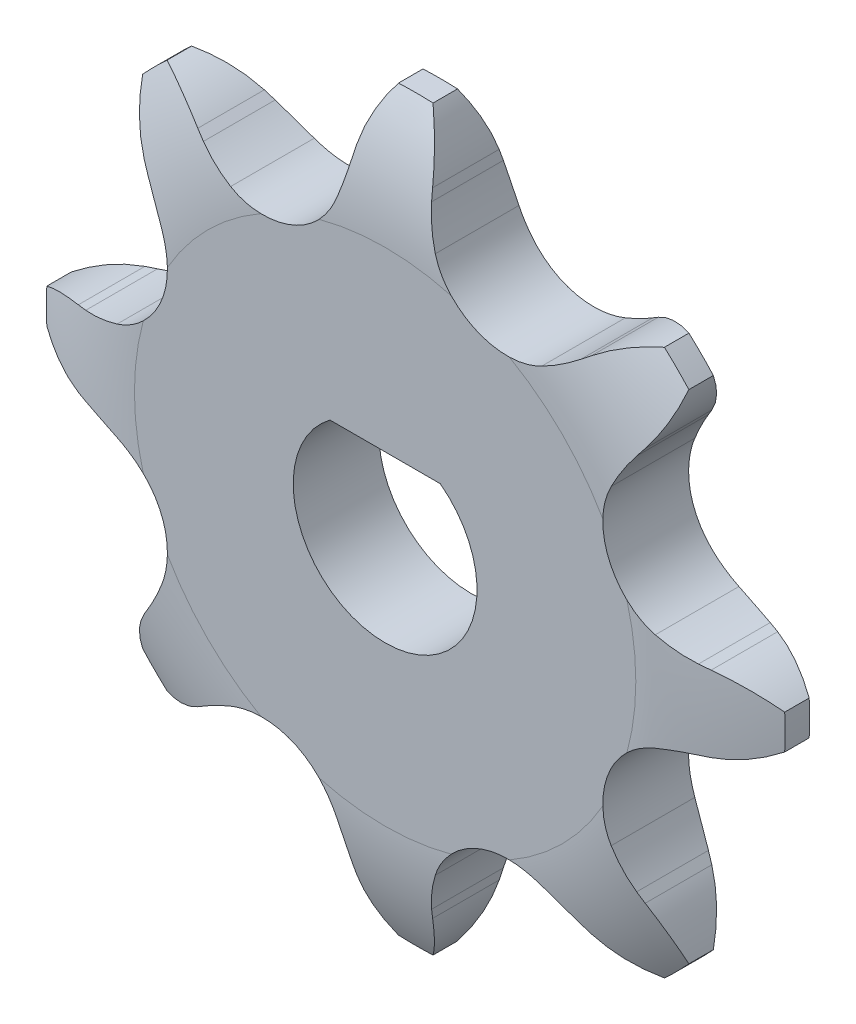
from build123d import *

# Parameters (mm, degrees)
CUT_EXTRUDE1_DEPTH      = 18.108345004
CIRPATTERN1_COUNT       = 8
BOSS_EXTRUDE1_START     = 1.4
SKETCH2_R               = 6.5
BOSS_EXTRUDE1_DEPTH     = 9.2
CUT_EXTRUDE2_DEPTH      = 21.077237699
CUT_EXTRUDE2_DEPTH_BACK = 21.077237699
SKETCH3_R               = 3
SKETCH4_W               = 2.1
SKETCH4_H               = 6.90435053
CUT_EXTRUDE4_START      = -9.2
SKETCH6_R               = 6.5
CUT_EXTRUDE4_DEPTH      = 9.2
BOSS_EXTRUDE2_START     = -2.8
BOSS_EXTRUDE2_DEPTH     = 2.8


with BuildPart() as part:
    # Sketch1 → Revolve1 (revolve)
    with BuildSketch(Plane(origin=(0, 0, 0), x_dir=(0, 0, -1), z_dir=(1, 0, 0))):
        with BuildLine():
            Line((1.4, 0), (-1.4, 0))
            Line((-1.4, 0), (-1.4, 8.183870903))
            ThreePointArc((-1.4, 8.183870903), (-1.145966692, 10.183870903), (-0.4, 12.056854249))
            Line((-0.4, 12.056854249), (0.4, 12.056854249))
            ThreePointArc((0.4, 12.056854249), (1.145966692, 10.183870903), (1.4, 8.183870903))
            Line((1.4, 8.183870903), (1.4, 0))
        make_face()
    revolve(axis=Axis((0, 0, -1.4), (0, 0, 1)))

    # Sketch0 → Cut-Extrude1 (cut, symmetric)
    with BuildSketch(Plane.XY):
        with BuildLine():
            Line((6.428309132, -8.177568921), (6.159873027, -7.982538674))
            ThreePointArc((6.159873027, -7.982538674), (5.634207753, -7.637897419), (5.077930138, -7.345225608))
            ThreePointArc((5.077930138, -7.345225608), (3.023927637, -7.300407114), (1.603220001, -8.784497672))
            ThreePointArc((1.603220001, -8.784497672), (1.41682255, -9.384795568), (1.288819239, -10.000195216))
            Line((1.288819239, -10.000195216), (1.236913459, -10.327915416))
            ThreePointArc((1.236913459, -10.327915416), (-0.73498539, -13.299856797), (-4.272650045, -13.753452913))
            ThreePointArc((-4.272650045, -13.753452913), (5.511345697, -13.305565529), (12.74637964, -6.703939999))
            ThreePointArc((12.74637964, -6.703939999), (9.924132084, -8.884705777), (6.428309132, -8.177568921))
        make_face()
    cut_extrude1 = extrude(amount=CUT_EXTRUDE1_DEPTH, both=True, mode=Mode.SUBTRACT)

    # CirPattern1: Cut-Extrude1 ×8 about axis
    cirpattern1_axis = Axis((0, 0, 0), (0, 0, 1))
    for i in range(1, CIRPATTERN1_COUNT):
        add(cut_extrude1.rotate(cirpattern1_axis, i * 360 / CIRPATTERN1_COUNT), mode=Mode.SUBTRACT)

    # Sketch2 → Boss-Extrude1 (add)
    with BuildSketch(Plane.XY.offset(BOSS_EXTRUDE1_START)):
        with Locations(Location((0, 0, 0), (0, 0, 270))):
            Circle(SKETCH2_R)
    extrude(amount=BOSS_EXTRUDE1_DEPTH)

    # Sketch3 → Cut-Extrude2 (cut, two sides: drawn at the far end of the back side and taken through both)
    with BuildSketch(Plane.XY.offset(-CUT_EXTRUDE2_DEPTH_BACK)):
        Circle(SKETCH3_R)
    extrude(amount=CUT_EXTRUDE2_DEPTH + CUT_EXTRUDE2_DEPTH_BACK, mode=Mode.SUBTRACT)

    # Sketch4 → Cut-Revolve1 (revolve, cut)
    with BuildSketch(Plane(origin=(0, 0, 0), x_dir=(0, 0, -1), z_dir=(1, 0, 0))):
        Polygon((-10.6, 6.5), (-10.6, 6), (-10.1, 6.5), align=None)
        with Locations((-2.45, 8.604678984)):
            Rectangle(SKETCH4_W, SKETCH4_H)
    revolve(axis=Axis((0, 0, -1.4), (0, 0, 1)), mode=Mode.SUBTRACT)

    # Sketch6 → Cut-Extrude4 (cut)
    with BuildSketch(Plane.XY.offset(10.6).offset(CUT_EXTRUDE4_START)):
        Circle(SKETCH6_R)
    extrude(amount=CUT_EXTRUDE4_DEPTH, mode=Mode.SUBTRACT)

    # Sketch7 → Boss-Extrude2 (add)
    with BuildSketch(Plane(origin=(0, 0, -1.4), x_dir=(-1, 0, 0), z_dir=(0, 0, -1)).offset(BOSS_EXTRUDE2_START)):
        with BuildLine():
            Line((-1.8, 2.4), (1.8, 2.4))
            ThreePointArc((1.8, 2.4), (0, 3), (-1.8, 2.4))
        make_face()
    extrude(amount=BOSS_EXTRUDE2_DEPTH)


solid = part.part
